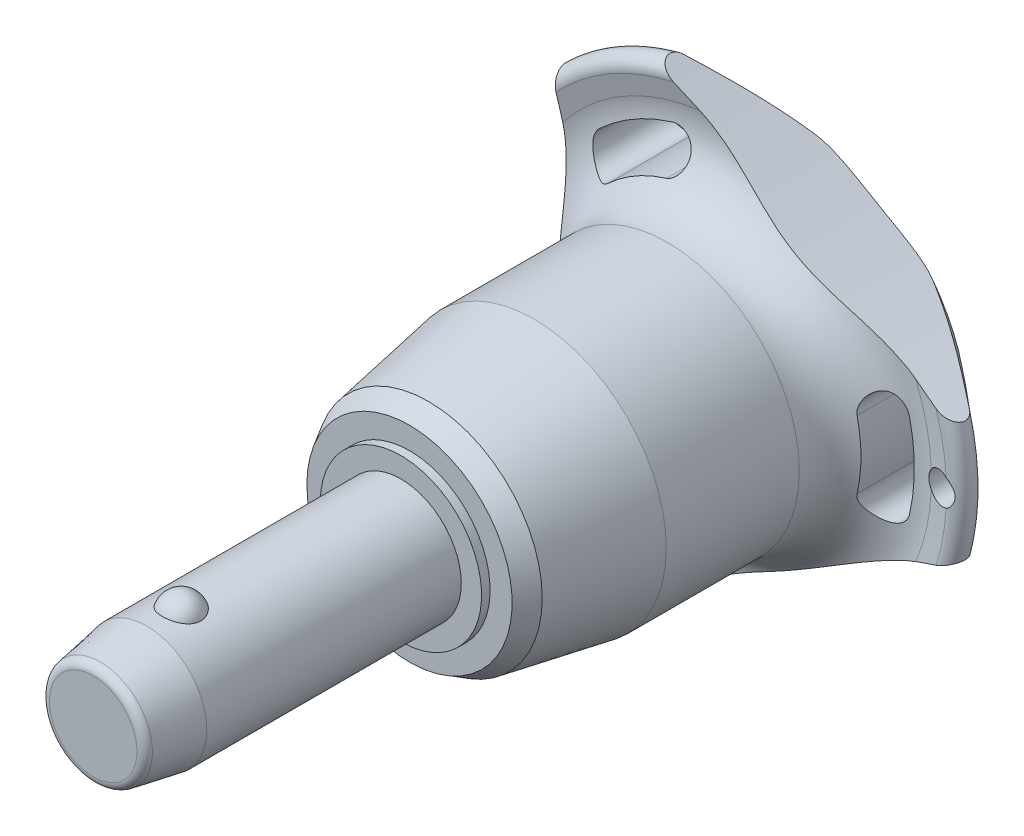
from build123d import *

# Parameters (mm, degrees)
SKETCH1_R           = 6
BOSS_EXTRUDE1_DEPTH = 20
SKETCH2_R           = 5.15
BOSS_EXTRUDE2_DEPTH = 39.7
BOSS_EXTRUDE3_START = 10.6
SKETCH1_2_R         = 6
BOSS_EXTRUDE3_DEPTH = 10.6
CHAMFER1_SIZE       = 5.3
CHAMFER1_SIZE2      = 0.934532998
FILLET1_R           = 0.85
SKETCH6_R           = 144.275
CUT_EXTRUDE1_DEPTH  = 69.537041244
CIRPATTERN1_COUNT   = 3
SKETCH7_R           = 1.5
CUT_EXTRUDE2_DEPTH  = 69.243593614


with BuildPart() as part:
    # Sketch1 → Boss-Extrude1 (new body)
    with BuildSketch(Plane.XY):
        Circle(SKETCH1_R)
    extrude(amount=-BOSS_EXTRUDE1_DEPTH)

    # Sketch2 → Boss-Extrude2 (add)
    with BuildSketch(Plane(origin=(0, 0, -20), x_dir=(-1, 0, 0), z_dir=(0, 0, -1))):
        Circle(SKETCH2_R)
    extrude(amount=BOSS_EXTRUDE2_DEPTH)

    # Sketch3 → Revolve1 (revolve)
    with BuildSketch(Plane(origin=(0, 0, 0), x_dir=(0, 0, -1), z_dir=(1, 0, 0))):
        with BuildLine():
            Line((-1.854049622, 7.25), (-1.854049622, 3.25))
            ThreePointArc((-1.854049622, 3.25), (0.145950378, 5.25), (-1.854049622, 7.25))
        make_face()
        with BuildLine():
            Line((-1.854049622, -3.25), (-1.854049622, -7.25))
            ThreePointArc((-1.854049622, -7.25), (0.145950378, -5.25), (-1.854049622, -3.25))
        make_face()
    revolve(axis=Axis((0, -3.25, 1.854049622), (0, 1, 0)))

    # Sketch1_2 → Boss-Extrude3 (add)
    with BuildSketch(Plane.XY.offset(BOSS_EXTRUDE3_START)):
        Circle(SKETCH1_2_R)
    extrude(amount=-BOSS_EXTRUDE3_DEPTH)

    # Chamfer1
    chamfer1_edges = [part.edges().sort_by_distance(p)[0] for p in [
        (-6, 0, 10.6),
    ]]
    chamfer1_side = [part.faces().sort_by_distance(p)[0] for p in [
        (-6, 0, -4.7),
    ]]
    chamfer(chamfer1_edges, length=CHAMFER1_SIZE, length2=CHAMFER1_SIZE2, reference=chamfer1_side[0])

    # Fillet1
    fillet1_edges = [part.edges().sort_by_distance(p)[0] for p in [
        (-5.065467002, 0, 10.6),
        (5.15, 0, -59.7),
    ]]
    fillet(fillet1_edges, radius=FILLET1_R)

    # Sketch4 → Revolve2 (revolve)
    with BuildSketch(Plane(origin=(0, 0, 0), x_dir=(0, 0, -1), z_dir=(1, 0, 0)), mode=Mode.PRIVATE) as revolve2_sk:
        Polygon((20, 0), (20, 8.017240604), (20.85, 8.017240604), (20.85, 10.206249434), (22.745737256, 11.300753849), (33.233333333, 13.15), (46.466666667, 13.15), (46.466666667, 0), align=None)
    revolve(revolve2_sk.sketch.rotate(Axis((0, 0, -46.466666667), (0, 0, 1)), 90), axis=Axis((0, 0, -46.466666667), (0, 0, 1)))

    # Sketch5 → Revolve3 (revolve)
    with BuildSketch(Plane(origin=(0, 0, 0), x_dir=(0, 0, -1), z_dir=(1, 0, 0)), mode=Mode.PRIVATE) as revolve3_sk:
        with BuildLine():
            Line((52.32877039, 20.428960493), (51.910912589, 22.344207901))
            ThreePointArc((51.910912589, 22.344207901), (52.554394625, 23.677136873), (54.002586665, 23.371345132))
            Line((54.002586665, 23.371345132), (59.141488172, 17.247040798))
            ThreePointArc((59.141488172, 17.247040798), (59.7, 15.584758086), (58.978803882, 13.986322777))
            ThreePointArc((58.978803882, 13.986322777), (54.617427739, 7.589034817), (53.083333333, 0))
            Line((53.083333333, 0), (46.466666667, 0))
            Line((46.466666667, 0), (46.466666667, 13.15))
            ThreePointArc((46.466666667, 13.15), (51.139661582, 15.38660811), (52.32877039, 20.428960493))
        make_face()
    revolve(revolve3_sk.sketch.rotate(Axis((0, 0, -53.083333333), (0, 0, 1)), 90), axis=Axis((0, 0, -53.083333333), (0, 0, 1)))

    # Sketch6 → Cut-Extrude1 (cut, through all)
    with BuildSketch(Plane.XY):
        with Locations((-159.975, 0)):
            Circle(SKETCH6_R)
        with BuildLine():
            ThreePointArc((18.131206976, -4.190753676), (18.60922037, 0), (18.131206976, 4.190753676))
            ThreePointArc((18.131206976, 4.190753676), (15.94840906, 5.553949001), (14.585213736, 3.371151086))
            ThreePointArc((14.585213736, 3.371151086), (14.969740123, 0), (14.585213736, -3.371151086))
            ThreePointArc((14.585213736, -3.371151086), (15.94840906, -5.553949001), (18.131206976, -4.190753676))
        make_face()
    cut_extrude1 = extrude(amount=-CUT_EXTRUDE1_DEPTH, mode=Mode.SUBTRACT)

    # CirPattern1: Cut-Extrude1 ×3 about axis
    cirpattern1_axis = Axis((0, 0, 0), (0, 0, 1))
    for i in range(1, CIRPATTERN1_COUNT):
        add(cut_extrude1.rotate(cirpattern1_axis, i * 360 / CIRPATTERN1_COUNT), mode=Mode.SUBTRACT)

    # Sketch7 → Cut-Extrude2 (cut, through all)
    with BuildSketch(Plane.XY):
        with Locations(Location((21.60922037, 0, 0), (0, 0, 297.620773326))):
            Circle(SKETCH7_R)
    extrude(amount=-CUT_EXTRUDE2_DEPTH, mode=Mode.SUBTRACT)


solid = part.part
